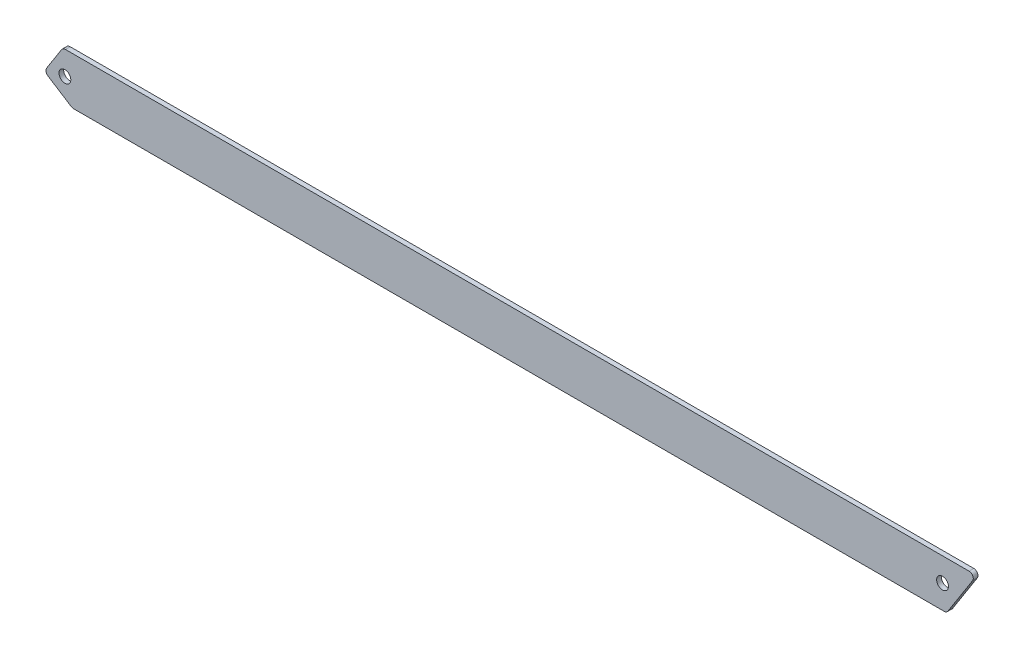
ISO-10303-21;
HEADER;
FILE_DESCRIPTION(('STEP AP214'),'2;1');
FILE_NAME('part.step','',(''),(''),'','','');
FILE_SCHEMA(('AUTOMOTIVE_DESIGN { 1 0 10303 214 1 1 1 1 }'));
ENDSEC;
DATA;
#1=APPLICATION_CONTEXT('core data for automotive mechanical design processes');
#2=APPLICATION_PROTOCOL_DEFINITION('international standard','automotive_design',2000,#1);
#3=PRODUCT_CONTEXT('',#1,'mechanical');
#4=PRODUCT('Part','Part','',(#3));
#5=PRODUCT_RELATED_PRODUCT_CATEGORY('part','',(#4));
#6=PRODUCT_DEFINITION_FORMATION('','',#4);
#7=PRODUCT_DEFINITION_CONTEXT('part definition',#1,'design');
#8=PRODUCT_DEFINITION('design','',#6,#7);
#9=PRODUCT_DEFINITION_SHAPE('','',#8);
#10=(LENGTH_UNIT() NAMED_UNIT(*) SI_UNIT(.MILLI.,.METRE.));
#11=(NAMED_UNIT(*) PLANE_ANGLE_UNIT() SI_UNIT($,.RADIAN.));
#12=(NAMED_UNIT(*) SI_UNIT($,.STERADIAN.) SOLID_ANGLE_UNIT());
#13=UNCERTAINTY_MEASURE_WITH_UNIT(LENGTH_MEASURE(1.E-05),#10,'distance_accuracy_value','');
#14=(GEOMETRIC_REPRESENTATION_CONTEXT(3) GLOBAL_UNCERTAINTY_ASSIGNED_CONTEXT((#13)) GLOBAL_UNIT_ASSIGNED_CONTEXT((#10,
#11,#12)) REPRESENTATION_CONTEXT('',''));
#15=CARTESIAN_POINT('',(0.,0.,0.));
#16=DIRECTION('',(0.,0.,1.));
#17=DIRECTION('',(1.,0.,0.));
#18=AXIS2_PLACEMENT_3D('',#15,#16,#17);
#19=CARTESIAN_POINT('',(0.793750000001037,25.4000000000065,-6.34999999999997));
#20=DIRECTION('',(0.,0.,0.999999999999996));
#21=DIRECTION('',(0.999999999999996,0.,0.));
#22=AXIS2_PLACEMENT_3D('',#19,#20,#21);
#23=CYLINDRICAL_SURFACE('',#22,6.35000000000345);
#24=CARTESIAN_POINT('',(0.793750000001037,25.4000000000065,0.));
#25=DIRECTION('',(0.,0.,0.999999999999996));
#26=DIRECTION('',(0.999999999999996,0.,0.));
#27=AXIS2_PLACEMENT_3D('',#24,#25,#26);
#28=CIRCLE('',#27,6.35000000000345);
#29=CARTESIAN_POINT('',(0.793750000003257,31.7500000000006,0.));
#30=VERTEX_POINT('',#29);
#31=CARTESIAN_POINT('',(-4.56178568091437,28.811852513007,0.));
#32=VERTEX_POINT('',#31);
#33=EDGE_CURVE('E143',#30,#32,#28,.T.);
#34=ORIENTED_EDGE('',*,*,#33,.F.);
#35=DIRECTION('',(0.,0.,0.999999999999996));
#36=VECTOR('',#35,1.);
#37=CARTESIAN_POINT('',(0.793750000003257,31.7500000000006,-6.34999999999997));
#38=LINE('',#37,#36);
#39=CARTESIAN_POINT('',(0.793750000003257,31.7500000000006,-6.34999999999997));
#40=VERTEX_POINT('',#39);
#41=EDGE_CURVE('E11',#40,#30,#38,.T.);
#42=ORIENTED_EDGE('',*,*,#41,.F.);
#43=CARTESIAN_POINT('',(0.793750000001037,25.4000000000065,-6.34999999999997));
#44=DIRECTION('',(0.,0.,0.999999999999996));
#45=DIRECTION('',(0.999999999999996,0.,0.));
#46=AXIS2_PLACEMENT_3D('',#43,#44,#45);
#47=CIRCLE('',#46,6.35000000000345);
#48=CARTESIAN_POINT('',(-4.56178568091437,28.811852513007,-6.34999999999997));
#49=VERTEX_POINT('',#48);
#50=EDGE_CURVE('E170',#40,#49,#47,.T.);
#51=ORIENTED_EDGE('',*,*,#50,.T.);
#52=DIRECTION('',(0.,0.,0.999999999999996));
#53=VECTOR('',#52,1.);
#54=CARTESIAN_POINT('',(-4.56178568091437,28.811852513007,-6.34999999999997));
#55=LINE('',#54,#53);
#56=EDGE_CURVE('E37',#49,#32,#55,.T.);
#57=ORIENTED_EDGE('',*,*,#56,.T.);
#58=EDGE_LOOP('',(#34,#42,#51,#57));
#59=FACE_BOUND('',#58,.T.);
#60=ADVANCED_FACE('F34',(#59),#23,.T.);
#61=CARTESIAN_POINT('',(1214.74247758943,31.7500000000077,-6.35000000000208));
#62=DIRECTION('',(0.,1.,0.));
#63=DIRECTION('',(-0.999999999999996,0.,0.));
#64=AXIS2_PLACEMENT_3D('',#61,#62,#63);
#65=PLANE('',#64);
#66=DIRECTION('',(-0.999999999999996,0.,0.));
#67=VECTOR('',#66,1.);
#68=CARTESIAN_POINT('',(1214.74247758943,31.7500000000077,-1.99840144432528E-12));
#69=LINE('',#68,#67);
#70=CARTESIAN_POINT('',(1214.74247758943,31.7500000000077,-1.99840144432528E-12));
#71=VERTEX_POINT('',#70);
#72=EDGE_CURVE('E168',#71,#30,#69,.T.);
#73=ORIENTED_EDGE('',*,*,#72,.F.);
#74=DIRECTION('',(0.,0.,0.999999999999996));
#75=VECTOR('',#74,1.);
#76=CARTESIAN_POINT('',(1214.74247758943,31.7500000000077,-6.35000000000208));
#77=LINE('',#76,#75);
#78=CARTESIAN_POINT('',(1214.74247758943,31.7500000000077,-6.35000000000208));
#79=VERTEX_POINT('',#78);
#80=EDGE_CURVE('E43',#79,#71,#77,.T.);
#81=ORIENTED_EDGE('',*,*,#80,.F.);
#82=DIRECTION('',(-0.999999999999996,0.,0.));
#83=VECTOR('',#82,1.);
#84=CARTESIAN_POINT('',(1214.74247758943,31.7500000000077,-6.35000000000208));
#85=LINE('',#84,#83);
#86=EDGE_CURVE('E133',#79,#40,#85,.T.);
#87=ORIENTED_EDGE('',*,*,#86,.T.);
#88=ORIENTED_EDGE('',*,*,#41,.T.);
#89=EDGE_LOOP('',(#73,#81,#87,#88));
#90=FACE_BOUND('',#89,.T.);
#91=ADVANCED_FACE('F186',(#90),#65,.T.);
#92=CARTESIAN_POINT('',(1214.74247758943,26.1018525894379,-6.35000000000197));
#93=DIRECTION('',(0.,0.,0.999999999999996));
#94=DIRECTION('',(0.999999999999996,0.,0.));
#95=AXIS2_PLACEMENT_3D('',#92,#93,#94);
#96=CYLINDRICAL_SURFACE('',#95,5.6481474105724);
#97=CARTESIAN_POINT('',(1214.74247758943,26.1018525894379,-1.99840144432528E-12));
#98=DIRECTION('',(0.,0.,0.999999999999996));
#99=DIRECTION('',(0.999999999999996,0.,0.));
#100=AXIS2_PLACEMENT_3D('',#97,#98,#99);
#101=CIRCLE('',#100,5.6481474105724);
#102=CARTESIAN_POINT('',(1219.5060768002,23.0671051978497,-1.99840144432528E-12));
#103=VERTEX_POINT('',#102);
#104=EDGE_CURVE('E120',#103,#71,#101,.T.);
#105=ORIENTED_EDGE('',*,*,#104,.F.);
#106=DIRECTION('',(0.,0.,0.999999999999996));
#107=VECTOR('',#106,1.);
#108=CARTESIAN_POINT('',(1219.5060768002,23.0671051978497,-6.35000000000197));
#109=LINE('',#108,#107);
#110=CARTESIAN_POINT('',(1219.5060768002,23.0671051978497,-6.35000000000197));
#111=VERTEX_POINT('',#110);
#112=EDGE_CURVE('E115',#111,#103,#109,.T.);
#113=ORIENTED_EDGE('',*,*,#112,.F.);
#114=CARTESIAN_POINT('',(1214.74247758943,26.1018525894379,-6.35000000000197));
#115=DIRECTION('',(0.,0.,0.999999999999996));
#116=DIRECTION('',(0.999999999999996,0.,0.));
#117=AXIS2_PLACEMENT_3D('',#114,#115,#116);
#118=CIRCLE('',#117,5.6481474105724);
#119=EDGE_CURVE('E118',#111,#79,#118,.T.);
#120=ORIENTED_EDGE('',*,*,#119,.T.);
#121=ORIENTED_EDGE('',*,*,#80,.T.);
#122=EDGE_LOOP('',(#105,#113,#120,#121));
#123=FACE_BOUND('',#122,.T.);
#124=ADVANCED_FACE('F117',(#123),#96,.T.);
#125=CARTESIAN_POINT('',(1186.45553568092,-28.8118525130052,-6.35000000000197));
#126=DIRECTION('',(0.843391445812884,-0.537299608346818,0.));
#127=DIRECTION('',(0.537299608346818,0.843391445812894,0.));
#128=AXIS2_PLACEMENT_3D('',#125,#126,#127);
#129=PLANE('',#128);
#130=DIRECTION('',(0.537299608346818,0.843391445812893,0.));
#131=VECTOR('',#130,1.);
#132=CARTESIAN_POINT('',(1186.45553568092,-28.8118525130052,-1.99840144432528E-12));
#133=LINE('',#132,#131);
#134=CARTESIAN_POINT('',(1186.45553568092,-28.8118525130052,-1.99840144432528E-12));
#135=VERTEX_POINT('',#134);
#136=EDGE_CURVE('E165',#135,#103,#133,.T.);
#137=ORIENTED_EDGE('',*,*,#136,.F.);
#138=DIRECTION('',(0.,0.,0.999999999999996));
#139=VECTOR('',#138,1.);
#140=CARTESIAN_POINT('',(1186.45553568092,-28.8118525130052,-6.35000000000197));
#141=LINE('',#140,#139);
#142=CARTESIAN_POINT('',(1186.45553568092,-28.8118525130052,-6.35000000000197));
#143=VERTEX_POINT('',#142);
#144=EDGE_CURVE('E125',#143,#135,#141,.T.);
#145=ORIENTED_EDGE('',*,*,#144,.F.);
#146=DIRECTION('',(0.537299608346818,0.843391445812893,0.));
#147=VECTOR('',#146,1.);
#148=CARTESIAN_POINT('',(1186.45553568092,-28.8118525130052,-6.35000000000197));
#149=LINE('',#148,#147);
#150=EDGE_CURVE('E131',#143,#111,#149,.T.);
#151=ORIENTED_EDGE('',*,*,#150,.T.);
#152=ORIENTED_EDGE('',*,*,#112,.T.);
#153=EDGE_LOOP('',(#137,#145,#151,#152));
#154=FACE_BOUND('',#153,.T.);
#155=ADVANCED_FACE('F135',(#154),#129,.T.);
#156=CARTESIAN_POINT('',(1181.1,-25.3999999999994,-6.35000000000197));
#157=DIRECTION('',(0.,0.,0.999999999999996));
#158=DIRECTION('',(0.999999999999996,0.,0.));
#159=AXIS2_PLACEMENT_3D('',#156,#157,#158);
#160=CYLINDRICAL_SURFACE('',#159,6.35000000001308);
#161=CARTESIAN_POINT('',(1181.1,-25.3999999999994,-1.99840144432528E-12));
#162=DIRECTION('',(0.,0.,0.999999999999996));
#163=DIRECTION('',(0.999999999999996,0.,0.));
#164=AXIS2_PLACEMENT_3D('',#161,#162,#163);
#165=CIRCLE('',#164,6.35000000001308);
#166=CARTESIAN_POINT('',(1181.1,-31.7500000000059,-1.99840144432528E-12));
#167=VERTEX_POINT('',#166);
#168=EDGE_CURVE('E162',#167,#135,#165,.T.);
#169=ORIENTED_EDGE('',*,*,#168,.F.);
#170=DIRECTION('',(0.,0.,0.999999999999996));
#171=VECTOR('',#170,1.);
#172=CARTESIAN_POINT('',(1181.1,-31.7500000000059,-6.35000000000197));
#173=LINE('',#172,#171);
#174=CARTESIAN_POINT('',(1181.1,-31.7500000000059,-6.35000000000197));
#175=VERTEX_POINT('',#174);
#176=EDGE_CURVE('E174',#175,#167,#173,.T.);
#177=ORIENTED_EDGE('',*,*,#176,.F.);
#178=CARTESIAN_POINT('',(1181.1,-25.3999999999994,-6.35000000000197));
#179=DIRECTION('',(0.,0.,0.999999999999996));
#180=DIRECTION('',(0.999999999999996,0.,0.));
#181=AXIS2_PLACEMENT_3D('',#178,#179,#180);
#182=CIRCLE('',#181,6.35000000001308);
#183=EDGE_CURVE('E136',#175,#143,#182,.T.);
#184=ORIENTED_EDGE('',*,*,#183,.T.);
#185=ORIENTED_EDGE('',*,*,#144,.T.);
#186=EDGE_LOOP('',(#169,#177,#184,#185));
#187=FACE_BOUND('',#186,.T.);
#188=ADVANCED_FACE('F199',(#187),#160,.T.);
#189=CARTESIAN_POINT('',(11.7967574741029,-31.7500000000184,-6.34999999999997));
#190=DIRECTION('',(0.,-1.,0.));
#191=DIRECTION('',(0.,0.,-0.999999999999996));
#192=AXIS2_PLACEMENT_3D('',#189,#190,#191);
#193=PLANE('',#192);
#194=DIRECTION('',(0.999999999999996,0.,0.));
#195=VECTOR('',#194,1.);
#196=CARTESIAN_POINT('',(11.7967574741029,-31.7500000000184,0.));
#197=LINE('',#196,#195);
#198=CARTESIAN_POINT('',(11.7967574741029,-31.7500000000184,0.));
#199=VERTEX_POINT('',#198);
#200=EDGE_CURVE('E159',#199,#167,#197,.T.);
#201=ORIENTED_EDGE('',*,*,#200,.F.);
#202=DIRECTION('',(0.,0.,0.999999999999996));
#203=VECTOR('',#202,1.);
#204=CARTESIAN_POINT('',(11.7967574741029,-31.7500000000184,-6.34999999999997));
#205=LINE('',#204,#203);
#206=CARTESIAN_POINT('',(11.7967574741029,-31.7500000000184,-6.34999999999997));
#207=VERTEX_POINT('',#206);
#208=EDGE_CURVE('E176',#207,#199,#205,.T.);
#209=ORIENTED_EDGE('',*,*,#208,.F.);
#210=DIRECTION('',(0.999999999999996,0.,0.));
#211=VECTOR('',#210,1.);
#212=CARTESIAN_POINT('',(11.7967574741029,-31.7500000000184,-6.34999999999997));
#213=LINE('',#212,#211);
#214=EDGE_CURVE('E138',#207,#175,#213,.T.);
#215=ORIENTED_EDGE('',*,*,#214,.T.);
#216=ORIENTED_EDGE('',*,*,#176,.T.);
#217=EDGE_LOOP('',(#201,#209,#215,#216));
#218=FACE_BOUND('',#217,.T.);
#219=ADVANCED_FACE('F202',(#218),#193,.T.);
#220=CARTESIAN_POINT('',(11.7967574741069,-25.4000000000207,-6.34999999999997));
#221=DIRECTION('',(0.,0.,0.999999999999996));
#222=DIRECTION('',(0.999999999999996,0.,0.));
#223=AXIS2_PLACEMENT_3D('',#220,#221,#222);
#224=CYLINDRICAL_SURFACE('',#223,6.34999999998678);
#225=CARTESIAN_POINT('',(11.7967574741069,-25.4000000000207,0.));
#226=DIRECTION('',(0.,0.,0.999999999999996));
#227=DIRECTION('',(0.999999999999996,0.,0.));
#228=AXIS2_PLACEMENT_3D('',#225,#226,#227);
#229=CIRCLE('',#228,6.34999999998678);
#230=CARTESIAN_POINT('',(8.38490496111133,-30.755535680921,0.));
#231=VERTEX_POINT('',#230);
#232=EDGE_CURVE('E156',#231,#199,#229,.T.);
#233=ORIENTED_EDGE('',*,*,#232,.F.);
#234=DIRECTION('',(0.,0.,0.999999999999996));
#235=VECTOR('',#234,1.);
#236=CARTESIAN_POINT('',(8.38490496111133,-30.755535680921,-6.34999999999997));
#237=LINE('',#236,#235);
#238=CARTESIAN_POINT('',(8.38490496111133,-30.755535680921,-6.34999999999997));
#239=VERTEX_POINT('',#238);
#240=EDGE_CURVE('E178',#239,#231,#237,.T.);
#241=ORIENTED_EDGE('',*,*,#240,.F.);
#242=CARTESIAN_POINT('',(11.7967574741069,-25.4000000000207,-6.34999999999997));
#243=DIRECTION('',(0.,0.,0.999999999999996));
#244=DIRECTION('',(0.999999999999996,0.,0.));
#245=AXIS2_PLACEMENT_3D('',#242,#243,#244);
#246=CIRCLE('',#245,6.34999999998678);
#247=EDGE_CURVE('E262',#239,#207,#246,.T.);
#248=ORIENTED_EDGE('',*,*,#247,.T.);
#249=ORIENTED_EDGE('',*,*,#208,.T.);
#250=EDGE_LOOP('',(#233,#241,#248,#249));
#251=FACE_BOUND('',#250,.T.);
#252=ADVANCED_FACE('F206',(#251),#224,.T.);
#253=CARTESIAN_POINT('',(-22.4618525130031,-11.1039838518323,-6.34999999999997));
#254=DIRECTION('',(-0.537299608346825,-0.843391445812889,0.));
#255=DIRECTION('',(0.843391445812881,-0.537299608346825,0.));
#256=AXIS2_PLACEMENT_3D('',#253,#254,#255);
#257=PLANE('',#256);
#258=DIRECTION('',(0.843391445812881,-0.537299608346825,0.));
#259=VECTOR('',#258,1.);
#260=CARTESIAN_POINT('',(-22.4618525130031,-11.1039838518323,0.));
#261=LINE('',#260,#259);
#262=CARTESIAN_POINT('',(-22.4618525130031,-11.1039838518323,0.));
#263=VERTEX_POINT('',#262);
#264=EDGE_CURVE('E153',#263,#231,#261,.T.);
#265=ORIENTED_EDGE('',*,*,#264,.F.);
#266=DIRECTION('',(0.,0.,0.999999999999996));
#267=VECTOR('',#266,1.);
#268=CARTESIAN_POINT('',(-22.4618525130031,-11.1039838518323,-6.34999999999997));
#269=LINE('',#268,#267);
#270=CARTESIAN_POINT('',(-22.4618525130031,-11.1039838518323,-6.34999999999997));
#271=VERTEX_POINT('',#270);
#272=EDGE_CURVE('E180',#271,#263,#269,.T.);
#273=ORIENTED_EDGE('',*,*,#272,.F.);
#274=DIRECTION('',(0.843391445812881,-0.537299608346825,0.));
#275=VECTOR('',#274,1.);
#276=CARTESIAN_POINT('',(-22.4618525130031,-11.1039838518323,-6.34999999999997));
#277=LINE('',#276,#275);
#278=EDGE_CURVE('E259',#271,#239,#277,.T.);
#279=ORIENTED_EDGE('',*,*,#278,.T.);
#280=ORIENTED_EDGE('',*,*,#240,.T.);
#281=EDGE_LOOP('',(#265,#273,#279,#280));
#282=FACE_BOUND('',#281,.T.);
#283=ADVANCED_FACE('F210',(#282),#257,.T.);
#284=CARTESIAN_POINT('',(-19.05,-5.74844817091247,-6.34999999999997));
#285=DIRECTION('',(0.,0.,0.999999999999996));
#286=DIRECTION('',(0.999999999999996,0.,0.));
#287=AXIS2_PLACEMENT_3D('',#284,#285,#286);
#288=CYLINDRICAL_SURFACE('',#287,6.34999999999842);
#289=CARTESIAN_POINT('',(-19.05,-5.74844817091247,0.));
#290=DIRECTION('',(0.,0.,0.999999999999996));
#291=DIRECTION('',(0.999999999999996,0.,0.));
#292=AXIS2_PLACEMENT_3D('',#289,#290,#291);
#293=CIRCLE('',#292,6.34999999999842);
#294=CARTESIAN_POINT('',(-24.4055356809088,-2.3365956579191,0.));
#295=VERTEX_POINT('',#294);
#296=EDGE_CURVE('E150',#295,#263,#293,.T.);
#297=ORIENTED_EDGE('',*,*,#296,.F.);
#298=DIRECTION('',(0.,0.,0.999999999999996));
#299=VECTOR('',#298,1.);
#300=CARTESIAN_POINT('',(-24.4055356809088,-2.3365956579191,-6.34999999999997));
#301=LINE('',#300,#299);
#302=CARTESIAN_POINT('',(-24.4055356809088,-2.3365956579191,-6.34999999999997));
#303=VERTEX_POINT('',#302);
#304=EDGE_CURVE('E181',#303,#295,#301,.T.);
#305=ORIENTED_EDGE('',*,*,#304,.F.);
#306=CARTESIAN_POINT('',(-19.05,-5.74844817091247,-6.34999999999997));
#307=DIRECTION('',(0.,0.,0.999999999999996));
#308=DIRECTION('',(0.999999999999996,0.,0.));
#309=AXIS2_PLACEMENT_3D('',#306,#307,#308);
#310=CIRCLE('',#309,6.34999999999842);
#311=EDGE_CURVE('E256',#303,#271,#310,.T.);
#312=ORIENTED_EDGE('',*,*,#311,.T.);
#313=ORIENTED_EDGE('',*,*,#272,.T.);
#314=EDGE_LOOP('',(#297,#305,#312,#313));
#315=FACE_BOUND('',#314,.T.);
#316=ADVANCED_FACE('F214',(#315),#288,.T.);
#317=CARTESIAN_POINT('',(-4.56178568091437,28.811852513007,-6.34999999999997));
#318=DIRECTION('',(-0.84339144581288,0.537299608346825,0.));
#319=DIRECTION('',(-0.537299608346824,-0.843391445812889,0.));
#320=AXIS2_PLACEMENT_3D('',#317,#318,#319);
#321=PLANE('',#320);
#322=DIRECTION('',(-0.537299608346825,-0.843391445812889,0.));
#323=VECTOR('',#322,1.);
#324=CARTESIAN_POINT('',(-4.56178568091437,28.811852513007,0.));
#325=LINE('',#324,#323);
#326=EDGE_CURVE('E146',#32,#295,#325,.T.);
#327=ORIENTED_EDGE('',*,*,#326,.F.);
#328=ORIENTED_EDGE('',*,*,#56,.F.);
#329=DIRECTION('',(-0.537299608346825,-0.843391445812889,0.));
#330=VECTOR('',#329,1.);
#331=CARTESIAN_POINT('',(-4.56178568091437,28.811852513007,-6.34999999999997));
#332=LINE('',#331,#330);
#333=EDGE_CURVE('E254',#49,#303,#332,.T.);
#334=ORIENTED_EDGE('',*,*,#333,.T.);
#335=ORIENTED_EDGE('',*,*,#304,.T.);
#336=EDGE_LOOP('',(#327,#328,#334,#335));
#337=FACE_BOUND('',#336,.T.);
#338=ADVANCED_FACE('F183',(#337),#321,.T.);
#339=CARTESIAN_POINT('',(0.793750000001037,25.4000000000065,-6.34999999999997));
#340=DIRECTION('',(0.,0.,0.999999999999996));
#341=DIRECTION('',(0.999999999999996,0.,0.));
#342=AXIS2_PLACEMENT_3D('',#339,#340,#341);
#343=PLANE('',#342);
#344=CARTESIAN_POINT('',(1179.115625,0.,-6.35000000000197));
#345=DIRECTION('',(0.,0.,0.999999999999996));
#346=DIRECTION('',(0.999999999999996,0.,0.));
#347=AXIS2_PLACEMENT_3D('',#344,#345,#346);
#348=CIRCLE('',#347,7.93749999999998);
#349=CARTESIAN_POINT('',(1187.053125,0.,-6.35000000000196));
#350=VERTEX_POINT('',#349);
#351=EDGE_CURVE('E241',#350,#350,#348,.T.);
#352=ORIENTED_EDGE('',*,*,#351,.T.);
#353=EDGE_LOOP('',(#352));
#354=FACE_BOUND('',#353,.T.);
#355=CARTESIAN_POINT('',(0.,0.,-6.34999999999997));
#356=DIRECTION('',(0.,0.,0.999999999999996));
#357=DIRECTION('',(0.999999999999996,0.,0.));
#358=AXIS2_PLACEMENT_3D('',#355,#356,#357);
#359=CIRCLE('',#358,7.9375);
#360=CARTESIAN_POINT('',(7.93749999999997,0.,-6.34999999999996));
#361=VERTEX_POINT('',#360);
#362=EDGE_CURVE('E147',#361,#361,#359,.T.);
#363=ORIENTED_EDGE('',*,*,#362,.T.);
#364=EDGE_LOOP('',(#363));
#365=FACE_BOUND('',#364,.T.);
#366=ORIENTED_EDGE('',*,*,#50,.F.);
#367=ORIENTED_EDGE('',*,*,#86,.F.);
#368=ORIENTED_EDGE('',*,*,#119,.F.);
#369=ORIENTED_EDGE('',*,*,#150,.F.);
#370=ORIENTED_EDGE('',*,*,#183,.F.);
#371=ORIENTED_EDGE('',*,*,#214,.F.);
#372=ORIENTED_EDGE('',*,*,#247,.F.);
#373=ORIENTED_EDGE('',*,*,#278,.F.);
#374=ORIENTED_EDGE('',*,*,#311,.F.);
#375=ORIENTED_EDGE('',*,*,#333,.F.);
#376=EDGE_LOOP('',(#366,#367,#368,#369,#370,#371,#372,#373,#374,#375));
#377=FACE_BOUND('',#376,.T.);
#378=ADVANCED_FACE('F129',(#354,#365,#377),#343,.F.);
#379=CARTESIAN_POINT('',(0.793750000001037,25.4000000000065,0.));
#380=DIRECTION('',(0.,0.,0.999999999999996));
#381=DIRECTION('',(0.999999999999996,0.,0.));
#382=AXIS2_PLACEMENT_3D('',#379,#380,#381);
#383=PLANE('',#382);
#384=CARTESIAN_POINT('',(1179.115625,0.,-1.99840144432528E-12));
#385=DIRECTION('',(0.,0.,0.999999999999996));
#386=DIRECTION('',(0.999999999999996,0.,0.));
#387=AXIS2_PLACEMENT_3D('',#384,#385,#386);
#388=CIRCLE('',#387,7.93749999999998);
#389=CARTESIAN_POINT('',(1187.053125,0.,-1.99059518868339E-12));
#390=VERTEX_POINT('',#389);
#391=EDGE_CURVE('E244',#390,#390,#388,.T.);
#392=ORIENTED_EDGE('',*,*,#391,.F.);
#393=EDGE_LOOP('',(#392));
#394=FACE_BOUND('',#393,.T.);
#395=CARTESIAN_POINT('',(0.,0.,0.));
#396=DIRECTION('',(0.,0.,0.999999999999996));
#397=DIRECTION('',(0.999999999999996,0.,0.));
#398=AXIS2_PLACEMENT_3D('',#395,#396,#397);
#399=CIRCLE('',#398,7.9375);
#400=CARTESIAN_POINT('',(7.93749999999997,0.,0.));
#401=VERTEX_POINT('',#400);
#402=EDGE_CURVE('E246',#401,#401,#399,.T.);
#403=ORIENTED_EDGE('',*,*,#402,.F.);
#404=EDGE_LOOP('',(#403));
#405=FACE_BOUND('',#404,.T.);
#406=ORIENTED_EDGE('',*,*,#33,.T.);
#407=ORIENTED_EDGE('',*,*,#326,.T.);
#408=ORIENTED_EDGE('',*,*,#296,.T.);
#409=ORIENTED_EDGE('',*,*,#264,.T.);
#410=ORIENTED_EDGE('',*,*,#232,.T.);
#411=ORIENTED_EDGE('',*,*,#200,.T.);
#412=ORIENTED_EDGE('',*,*,#168,.T.);
#413=ORIENTED_EDGE('',*,*,#136,.T.);
#414=ORIENTED_EDGE('',*,*,#104,.T.);
#415=ORIENTED_EDGE('',*,*,#72,.T.);
#416=EDGE_LOOP('',(#406,#407,#408,#409,#410,#411,#412,#413,#414,#415));
#417=FACE_BOUND('',#416,.T.);
#418=ADVANCED_FACE('F185',(#394,#405,#417),#383,.T.);
#419=CARTESIAN_POINT('',(0.,0.,-6.34999999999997));
#420=DIRECTION('',(0.,0.,0.999999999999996));
#421=DIRECTION('',(0.999999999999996,0.,0.));
#422=AXIS2_PLACEMENT_3D('',#419,#420,#421);
#423=CYLINDRICAL_SURFACE('',#422,7.9375);
#424=CARTESIAN_POINT('',(7.93749999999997,0.,-6.34999999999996));
#425=CARTESIAN_POINT('',(7.93749999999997,0.,-6.28385416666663));
#426=CARTESIAN_POINT('',(7.93749999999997,0.,-6.21770833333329));
#427=CARTESIAN_POINT('',(7.93749999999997,0.,-6.08541666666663));
#428=CARTESIAN_POINT('',(7.93749999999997,0.,-6.01927083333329));
#429=CARTESIAN_POINT('',(7.93749999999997,0.,-5.88697916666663));
#430=CARTESIAN_POINT('',(7.93749999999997,0.,-5.8208333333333));
#431=CARTESIAN_POINT('',(7.93749999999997,0.,-5.68854166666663));
#432=CARTESIAN_POINT('',(7.93749999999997,0.,-5.6223958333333));
#433=CARTESIAN_POINT('',(7.93749999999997,0.,-5.49010416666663));
#434=CARTESIAN_POINT('',(7.93749999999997,0.,-5.4239583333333));
#435=CARTESIAN_POINT('',(7.93749999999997,0.,-5.29166666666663));
#436=CARTESIAN_POINT('',(7.93749999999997,0.,-5.2255208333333));
#437=CARTESIAN_POINT('',(7.93749999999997,0.,-5.09322916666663));
#438=CARTESIAN_POINT('',(7.93749999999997,0.,-5.0270833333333));
#439=CARTESIAN_POINT('',(7.93749999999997,0.,-4.89479166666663));
#440=CARTESIAN_POINT('',(7.93749999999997,0.,-4.8286458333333));
#441=CARTESIAN_POINT('',(7.93749999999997,0.,-4.69635416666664));
#442=CARTESIAN_POINT('',(7.93749999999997,0.,-4.6302083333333));
#443=CARTESIAN_POINT('',(7.93749999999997,0.,-4.49791666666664));
#444=CARTESIAN_POINT('',(7.93749999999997,0.,-4.4317708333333));
#445=CARTESIAN_POINT('',(7.93749999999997,0.,-4.29947916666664));
#446=CARTESIAN_POINT('',(7.93749999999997,0.,-4.2333333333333));
#447=CARTESIAN_POINT('',(7.93749999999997,0.,-4.10104166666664));
#448=CARTESIAN_POINT('',(7.93749999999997,0.,-4.03489583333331));
#449=CARTESIAN_POINT('',(7.93749999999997,0.,-3.90260416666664));
#450=CARTESIAN_POINT('',(7.93749999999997,0.,-3.83645833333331));
#451=CARTESIAN_POINT('',(7.93749999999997,0.,-3.70416666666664));
#452=CARTESIAN_POINT('',(7.93749999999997,0.,-3.63802083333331));
#453=CARTESIAN_POINT('',(7.93749999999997,0.,-3.50572916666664));
#454=CARTESIAN_POINT('',(7.93749999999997,0.,-3.43958333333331));
#455=CARTESIAN_POINT('',(7.93749999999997,0.,-3.30729166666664));
#456=CARTESIAN_POINT('',(7.93749999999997,0.,-3.24114583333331));
#457=CARTESIAN_POINT('',(7.93749999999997,0.,-3.10885416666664));
#458=CARTESIAN_POINT('',(7.93749999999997,0.,-3.04270833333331));
#459=CARTESIAN_POINT('',(7.93749999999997,0.,-2.91041666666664));
#460=CARTESIAN_POINT('',(7.93749999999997,0.,-2.84427083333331));
#461=CARTESIAN_POINT('',(7.93749999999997,0.,-2.71197916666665));
#462=CARTESIAN_POINT('',(7.93749999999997,0.,-2.64583333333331));
#463=CARTESIAN_POINT('',(7.93749999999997,0.,-2.51354166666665));
#464=CARTESIAN_POINT('',(7.93749999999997,0.,-2.44739583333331));
#465=CARTESIAN_POINT('',(7.93749999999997,0.,-2.31510416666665));
#466=CARTESIAN_POINT('',(7.93749999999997,0.,-2.24895833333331));
#467=CARTESIAN_POINT('',(7.93749999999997,0.,-2.11666666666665));
#468=CARTESIAN_POINT('',(7.93749999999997,0.,-2.05052083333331));
#469=CARTESIAN_POINT('',(7.93749999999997,0.,-1.91822916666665));
#470=CARTESIAN_POINT('',(7.93749999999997,0.,-1.85208333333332));
#471=CARTESIAN_POINT('',(7.93749999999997,0.,-1.71979166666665));
#472=CARTESIAN_POINT('',(7.93749999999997,0.,-1.65364583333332));
#473=CARTESIAN_POINT('',(7.93749999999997,0.,-1.52135416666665));
#474=CARTESIAN_POINT('',(7.93749999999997,0.,-1.45520833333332));
#475=CARTESIAN_POINT('',(7.93749999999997,0.,-1.32291666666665));
#476=CARTESIAN_POINT('',(7.93749999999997,0.,-1.25677083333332));
#477=CARTESIAN_POINT('',(7.93749999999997,0.,-1.12447916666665));
#478=CARTESIAN_POINT('',(7.93749999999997,0.,-1.05833333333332));
#479=CARTESIAN_POINT('',(7.93749999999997,0.,-0.926041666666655));
#480=CARTESIAN_POINT('',(7.93749999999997,0.,-0.859895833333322));
#481=CARTESIAN_POINT('',(7.93749999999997,0.,-0.727604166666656));
#482=CARTESIAN_POINT('',(7.93749999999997,0.,-0.661458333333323));
#483=CARTESIAN_POINT('',(7.93749999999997,0.,-0.529166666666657));
#484=CARTESIAN_POINT('',(7.93749999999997,0.,-0.463020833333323));
#485=CARTESIAN_POINT('',(7.93749999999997,0.,-0.330729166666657));
#486=CARTESIAN_POINT('',(7.93749999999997,0.,-0.264583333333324));
#487=CARTESIAN_POINT('',(7.93749999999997,0.,-0.132291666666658));
#488=CARTESIAN_POINT('',(7.93749999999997,0.,-0.0661458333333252));
#489=CARTESIAN_POINT('',(7.93749999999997,0.,0.));
#490=B_SPLINE_CURVE_WITH_KNOTS('',3,(#424,#425,#426,#427,#428,#429,#430,#431,#432,#433,#434,
#435,#436,#437,#438,#439,#440,#441,#442,#443,#444,#445,#446,#447,#448,#449,#450,#451,#452,#453,
#454,#455,#456,#457,#458,#459,#460,#461,#462,#463,#464,#465,#466,#467,#468,#469,#470,#471,#472,
#473,#474,#475,#476,#477,#478,#479,#480,#481,#482,#483,#484,#485,#486,#487,#488,#489),
.UNSPECIFIED.,.F.,.F.,(4,2,2,2,2,2,2,2,2,2,2,2,2,2,2,2,2,2,2,2,2,2,2,2,2,2,2,2,2,2,2,2,4),(0.,
0.198437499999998,0.396874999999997,0.595312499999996,0.793749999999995,0.992187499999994,
1.19062499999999,1.38906249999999,1.58749999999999,1.78593749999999,1.98437499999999,
2.18281249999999,2.38124999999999,2.57968749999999,2.77812499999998,2.97656249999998,
3.17499999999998,3.37343749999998,3.57187499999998,3.77031249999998,3.96874999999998,
4.16718749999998,4.36562499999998,4.56406249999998,4.76249999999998,4.96093749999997,
5.15937499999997,5.35781249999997,5.55624999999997,5.75468749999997,5.95312499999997,
6.15156249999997,6.34999999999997),.UNSPECIFIED.);
#491=EDGE_CURVE('BSEAM226',#361,#401,#490,.T.);
#492=ORIENTED_EDGE('',*,*,#362,.F.);
#493=ORIENTED_EDGE('',*,*,#402,.T.);
#494=ORIENTED_EDGE('',*,*,#491,.T.);
#495=ORIENTED_EDGE('',*,*,#491,.F.);
#496=EDGE_LOOP('',(#492,#494,#493,#495));
#497=FACE_BOUND('',#496,.T.);
#498=ADVANCED_FACE('F226',(#497),#423,.F.);
#499=CARTESIAN_POINT('',(1179.115625,0.,-6.35000000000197));
#500=DIRECTION('',(0.,0.,0.999999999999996));
#501=DIRECTION('',(0.999999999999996,0.,0.));
#502=AXIS2_PLACEMENT_3D('',#499,#500,#501);
#503=CYLINDRICAL_SURFACE('',#502,7.93749999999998);
#504=CARTESIAN_POINT('',(1187.053125,0.,-6.35000000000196));
#505=CARTESIAN_POINT('',(1187.053125,0.,-6.28385416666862));
#506=CARTESIAN_POINT('',(1187.053125,0.,-6.21770833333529));
#507=CARTESIAN_POINT('',(1187.053125,0.,-6.08541666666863));
#508=CARTESIAN_POINT('',(1187.053125,0.,-6.01927083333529));
#509=CARTESIAN_POINT('',(1187.053125,0.,-5.88697916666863));
#510=CARTESIAN_POINT('',(1187.053125,0.,-5.82083333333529));
#511=CARTESIAN_POINT('',(1187.053125,0.,-5.68854166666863));
#512=CARTESIAN_POINT('',(1187.053125,0.,-5.6223958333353));
#513=CARTESIAN_POINT('',(1187.053125,0.,-5.49010416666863));
#514=CARTESIAN_POINT('',(1187.053125,0.,-5.4239583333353));
#515=CARTESIAN_POINT('',(1187.053125,0.,-5.29166666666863));
#516=CARTESIAN_POINT('',(1187.053125,0.,-5.2255208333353));
#517=CARTESIAN_POINT('',(1187.053125,0.,-5.09322916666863));
#518=CARTESIAN_POINT('',(1187.053125,0.,-5.0270833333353));
#519=CARTESIAN_POINT('',(1187.053125,0.,-4.89479166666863));
#520=CARTESIAN_POINT('',(1187.053125,0.,-4.8286458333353));
#521=CARTESIAN_POINT('',(1187.053125,0.,-4.69635416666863));
#522=CARTESIAN_POINT('',(1187.053125,0.,-4.6302083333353));
#523=CARTESIAN_POINT('',(1187.053125,0.,-4.49791666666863));
#524=CARTESIAN_POINT('',(1187.053125,0.,-4.4317708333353));
#525=CARTESIAN_POINT('',(1187.053125,0.,-4.29947916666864));
#526=CARTESIAN_POINT('',(1187.053125,0.,-4.2333333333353));
#527=CARTESIAN_POINT('',(1187.053125,0.,-4.10104166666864));
#528=CARTESIAN_POINT('',(1187.053125,0.,-4.0348958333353));
#529=CARTESIAN_POINT('',(1187.053125,0.,-3.90260416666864));
#530=CARTESIAN_POINT('',(1187.053125,0.,-3.8364583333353));
#531=CARTESIAN_POINT('',(1187.053125,0.,-3.70416666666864));
#532=CARTESIAN_POINT('',(1187.053125,0.,-3.63802083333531));
#533=CARTESIAN_POINT('',(1187.053125,0.,-3.50572916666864));
#534=CARTESIAN_POINT('',(1187.053125,0.,-3.43958333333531));
#535=CARTESIAN_POINT('',(1187.053125,0.,-3.30729166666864));
#536=CARTESIAN_POINT('',(1187.053125,0.,-3.24114583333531));
#537=CARTESIAN_POINT('',(1187.053125,0.,-3.10885416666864));
#538=CARTESIAN_POINT('',(1187.053125,0.,-3.04270833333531));
#539=CARTESIAN_POINT('',(1187.053125,0.,-2.91041666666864));
#540=CARTESIAN_POINT('',(1187.053125,0.,-2.84427083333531));
#541=CARTESIAN_POINT('',(1187.053125,0.,-2.71197916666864));
#542=CARTESIAN_POINT('',(1187.053125,0.,-2.64583333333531));
#543=CARTESIAN_POINT('',(1187.053125,0.,-2.51354166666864));
#544=CARTESIAN_POINT('',(1187.053125,0.,-2.44739583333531));
#545=CARTESIAN_POINT('',(1187.053125,0.,-2.31510416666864));
#546=CARTESIAN_POINT('',(1187.053125,0.,-2.24895833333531));
#547=CARTESIAN_POINT('',(1187.053125,0.,-2.11666666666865));
#548=CARTESIAN_POINT('',(1187.053125,0.,-2.05052083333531));
#549=CARTESIAN_POINT('',(1187.053125,0.,-1.91822916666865));
#550=CARTESIAN_POINT('',(1187.053125,0.,-1.85208333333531));
#551=CARTESIAN_POINT('',(1187.053125,0.,-1.71979166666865));
#552=CARTESIAN_POINT('',(1187.053125,0.,-1.65364583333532));
#553=CARTESIAN_POINT('',(1187.053125,0.,-1.52135416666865));
#554=CARTESIAN_POINT('',(1187.053125,0.,-1.45520833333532));
#555=CARTESIAN_POINT('',(1187.053125,0.,-1.32291666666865));
#556=CARTESIAN_POINT('',(1187.053125,0.,-1.25677083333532));
#557=CARTESIAN_POINT('',(1187.053125,0.,-1.12447916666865));
#558=CARTESIAN_POINT('',(1187.053125,0.,-1.05833333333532));
#559=CARTESIAN_POINT('',(1187.053125,0.,-0.926041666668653));
#560=CARTESIAN_POINT('',(1187.053125,0.,-0.85989583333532));
#561=CARTESIAN_POINT('',(1187.053125,0.,-0.727604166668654));
#562=CARTESIAN_POINT('',(1187.053125,0.,-0.661458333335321));
#563=CARTESIAN_POINT('',(1187.053125,0.,-0.529166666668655));
#564=CARTESIAN_POINT('',(1187.053125,0.,-0.463020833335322));
#565=CARTESIAN_POINT('',(1187.053125,0.,-0.330729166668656));
#566=CARTESIAN_POINT('',(1187.053125,0.,-0.264583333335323));
#567=CARTESIAN_POINT('',(1187.053125,0.,-0.132291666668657));
#568=CARTESIAN_POINT('',(1187.053125,0.,-0.0661458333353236));
#569=CARTESIAN_POINT('',(1187.053125,0.,-1.99059518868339E-12));
#570=B_SPLINE_CURVE_WITH_KNOTS('',3,(#504,#505,#506,#507,#508,#509,#510,#511,#512,#513,#514,
#515,#516,#517,#518,#519,#520,#521,#522,#523,#524,#525,#526,#527,#528,#529,#530,#531,#532,#533,
#534,#535,#536,#537,#538,#539,#540,#541,#542,#543,#544,#545,#546,#547,#548,#549,#550,#551,#552,
#553,#554,#555,#556,#557,#558,#559,#560,#561,#562,#563,#564,#565,#566,#567,#568,#569),
.UNSPECIFIED.,.F.,.F.,(4,2,2,2,2,2,2,2,2,2,2,2,2,2,2,2,2,2,2,2,2,2,2,2,2,2,2,2,2,2,2,2,4),(0.,
0.198437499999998,0.396874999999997,0.595312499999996,0.793749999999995,0.992187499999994,
1.19062499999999,1.38906249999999,1.58749999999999,1.78593749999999,1.98437499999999,
2.18281249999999,2.38124999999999,2.57968749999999,2.77812499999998,2.97656249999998,
3.17499999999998,3.37343749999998,3.57187499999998,3.77031249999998,3.96874999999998,
4.16718749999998,4.36562499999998,4.56406249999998,4.76249999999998,4.96093749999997,
5.15937499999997,5.35781249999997,5.55624999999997,5.75468749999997,5.95312499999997,
6.15156249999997,6.34999999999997),.UNSPECIFIED.);
#571=EDGE_CURVE('BSEAM233',#350,#390,#570,.T.);
#572=ORIENTED_EDGE('',*,*,#351,.F.);
#573=ORIENTED_EDGE('',*,*,#391,.T.);
#574=ORIENTED_EDGE('',*,*,#571,.T.);
#575=ORIENTED_EDGE('',*,*,#571,.F.);
#576=EDGE_LOOP('',(#572,#574,#573,#575));
#577=FACE_BOUND('',#576,.T.);
#578=ADVANCED_FACE('F233',(#577),#503,.F.);
#579=CLOSED_SHELL('',(#60,#91,#124,#155,#188,#219,#252,#283,#316,#338,#378,#418,#498,#578));
#580=MANIFOLD_SOLID_BREP('B2',#579);
#581=ADVANCED_BREP_SHAPE_REPRESENTATION('',(#18,#580),#14);
#582=SHAPE_DEFINITION_REPRESENTATION(#9,#581);
ENDSEC;
END-ISO-10303-21;
